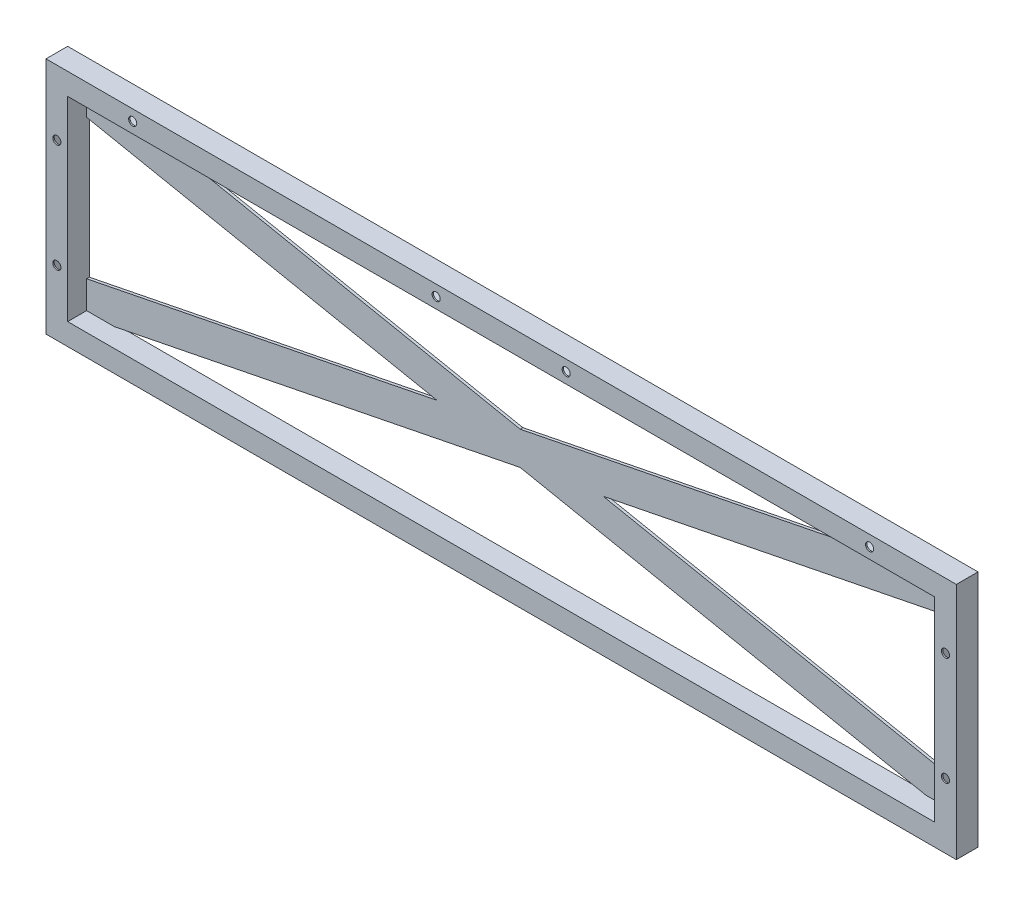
ISO-10303-21;
HEADER;
FILE_DESCRIPTION(('STEP AP214'),'2;1');
FILE_NAME('part.step','',(''),(''),'','','');
FILE_SCHEMA(('AUTOMOTIVE_DESIGN { 1 0 10303 214 1 1 1 1 }'));
ENDSEC;
DATA;
#1=APPLICATION_CONTEXT('core data for automotive mechanical design processes');
#2=APPLICATION_PROTOCOL_DEFINITION('international standard','automotive_design',2000,#1);
#3=PRODUCT_CONTEXT('',#1,'mechanical');
#4=PRODUCT('Part','Part','',(#3));
#5=PRODUCT_RELATED_PRODUCT_CATEGORY('part','',(#4));
#6=PRODUCT_DEFINITION_FORMATION('','',#4);
#7=PRODUCT_DEFINITION_CONTEXT('part definition',#1,'design');
#8=PRODUCT_DEFINITION('design','',#6,#7);
#9=PRODUCT_DEFINITION_SHAPE('','',#8);
#10=(LENGTH_UNIT() NAMED_UNIT(*) SI_UNIT(.MILLI.,.METRE.));
#11=(NAMED_UNIT(*) PLANE_ANGLE_UNIT() SI_UNIT($,.RADIAN.));
#12=(NAMED_UNIT(*) SI_UNIT($,.STERADIAN.) SOLID_ANGLE_UNIT());
#13=UNCERTAINTY_MEASURE_WITH_UNIT(LENGTH_MEASURE(1.E-05),#10,'distance_accuracy_value','');
#14=(GEOMETRIC_REPRESENTATION_CONTEXT(3) GLOBAL_UNCERTAINTY_ASSIGNED_CONTEXT((#13)) GLOBAL_UNIT_ASSIGNED_CONTEXT((#10,
#11,#12)) REPRESENTATION_CONTEXT('',''));
#15=CARTESIAN_POINT('',(0.,0.,0.));
#16=DIRECTION('',(0.,0.,1.));
#17=DIRECTION('',(1.,0.,0.));
#18=AXIS2_PLACEMENT_3D('',#15,#16,#17);
#19=CARTESIAN_POINT('',(0.,0.,25.4));
#20=DIRECTION('',(0.,0.,1.));
#21=DIRECTION('',(1.,0.,0.));
#22=AXIS2_PLACEMENT_3D('',#19,#20,#21);
#23=PLANE('',#22);
#24=CARTESIAN_POINT('',(-431.8,127.,25.4));
#25=DIRECTION('',(0.,0.,-1.));
#26=DIRECTION('',(-1.,0.,0.));
#27=AXIS2_PLACEMENT_3D('',#24,#25,#26);
#28=CIRCLE('',#27,4.76250000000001);
#29=CARTESIAN_POINT('',(-436.5625,127.,25.4));
#30=VERTEX_POINT('',#29);
#31=EDGE_CURVE('E385',#30,#30,#28,.T.);
#32=ORIENTED_EDGE('',*,*,#31,.T.);
#33=EDGE_LOOP('',(#32));
#34=FACE_BOUND('',#33,.T.);
#35=CARTESIAN_POINT('',(76.1999999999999,127.,25.4));
#36=DIRECTION('',(0.,0.,1.));
#37=DIRECTION('',(1.,0.,0.));
#38=AXIS2_PLACEMENT_3D('',#35,#36,#37);
#39=CIRCLE('',#38,4.7625);
#40=CARTESIAN_POINT('',(80.9624999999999,127.,25.4));
#41=VERTEX_POINT('',#40);
#42=EDGE_CURVE('E382',#41,#41,#39,.T.);
#43=ORIENTED_EDGE('',*,*,#42,.F.);
#44=EDGE_LOOP('',(#43));
#45=FACE_BOUND('',#44,.T.);
#46=CARTESIAN_POINT('',(431.8,127.,25.4));
#47=DIRECTION('',(0.,0.,1.));
#48=DIRECTION('',(1.,0.,0.));
#49=AXIS2_PLACEMENT_3D('',#46,#47,#48);
#50=CIRCLE('',#49,4.76250000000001);
#51=CARTESIAN_POINT('',(436.5625,127.,25.4));
#52=VERTEX_POINT('',#51);
#53=EDGE_CURVE('E401',#52,#52,#50,.T.);
#54=ORIENTED_EDGE('',*,*,#53,.F.);
#55=EDGE_LOOP('',(#54));
#56=FACE_BOUND('',#55,.T.);
#57=CARTESIAN_POINT('',(520.7,-63.5000000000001,25.4));
#58=DIRECTION('',(0.,0.,1.));
#59=DIRECTION('',(1.,0.,0.));
#60=AXIS2_PLACEMENT_3D('',#57,#58,#59);
#61=CIRCLE('',#60,4.76250000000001);
#62=CARTESIAN_POINT('',(525.4625,-63.5000000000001,25.4));
#63=VERTEX_POINT('',#62);
#64=EDGE_CURVE('E360',#63,#63,#61,.T.);
#65=ORIENTED_EDGE('',*,*,#64,.F.);
#66=EDGE_LOOP('',(#65));
#67=FACE_BOUND('',#66,.T.);
#68=CARTESIAN_POINT('',(-520.7,63.5000000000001,25.4));
#69=DIRECTION('',(0.,0.,1.));
#70=DIRECTION('',(1.,0.,0.));
#71=AXIS2_PLACEMENT_3D('',#68,#69,#70);
#72=CIRCLE('',#71,4.76250000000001);
#73=CARTESIAN_POINT('',(-515.9375,63.5000000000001,25.4));
#74=VERTEX_POINT('',#73);
#75=EDGE_CURVE('E350',#74,#74,#72,.T.);
#76=ORIENTED_EDGE('',*,*,#75,.F.);
#77=EDGE_LOOP('',(#76));
#78=FACE_BOUND('',#77,.T.);
#79=DIRECTION('',(0.,-1.,0.));
#80=VECTOR('',#79,1.);
#81=CARTESIAN_POINT('',(-533.4,-139.7,25.4));
#82=LINE('',#81,#80);
#83=CARTESIAN_POINT('',(-533.4,139.7,25.4));
#84=VERTEX_POINT('',#83);
#85=CARTESIAN_POINT('',(-533.4,-139.7,25.4));
#86=VERTEX_POINT('',#85);
#87=EDGE_CURVE('E260',#84,#86,#82,.T.);
#88=ORIENTED_EDGE('',*,*,#87,.T.);
#89=DIRECTION('',(1.,0.,0.));
#90=VECTOR('',#89,1.);
#91=CARTESIAN_POINT('',(533.4,-139.7,25.4));
#92=LINE('',#91,#90);
#93=CARTESIAN_POINT('',(533.4,-139.7,25.4));
#94=VERTEX_POINT('',#93);
#95=EDGE_CURVE('E263',#86,#94,#92,.T.);
#96=ORIENTED_EDGE('',*,*,#95,.T.);
#97=DIRECTION('',(0.,1.,0.));
#98=VECTOR('',#97,1.);
#99=CARTESIAN_POINT('',(533.4,-139.7,25.4));
#100=LINE('',#99,#98);
#101=CARTESIAN_POINT('',(533.4,139.7,25.4));
#102=VERTEX_POINT('',#101);
#103=EDGE_CURVE('E266',#94,#102,#100,.T.);
#104=ORIENTED_EDGE('',*,*,#103,.T.);
#105=DIRECTION('',(-1.,0.,0.));
#106=VECTOR('',#105,1.);
#107=CARTESIAN_POINT('',(533.4,139.7,25.4));
#108=LINE('',#107,#106);
#109=EDGE_CURVE('E268',#102,#84,#108,.T.);
#110=ORIENTED_EDGE('',*,*,#109,.T.);
#111=EDGE_LOOP('',(#88,#96,#104,#110));
#112=FACE_BOUND('',#111,.T.);
#113=DIRECTION('',(1.,0.,0.));
#114=VECTOR('',#113,1.);
#115=CARTESIAN_POINT('',(508.,-114.3,25.4));
#116=LINE('',#115,#114);
#117=CARTESIAN_POINT('',(-508.,-114.3,25.4));
#118=VERTEX_POINT('',#117);
#119=CARTESIAN_POINT('',(508.,-114.3,25.4));
#120=VERTEX_POINT('',#119);
#121=EDGE_CURVE('E512',#118,#120,#116,.T.);
#122=ORIENTED_EDGE('',*,*,#121,.F.);
#123=DIRECTION('',(0.,-1.,0.));
#124=VECTOR('',#123,1.);
#125=CARTESIAN_POINT('',(-508.,-114.3,25.4));
#126=LINE('',#125,#124);
#127=CARTESIAN_POINT('',(-508.,114.3,25.4));
#128=VERTEX_POINT('',#127);
#129=EDGE_CURVE('E510',#128,#118,#126,.T.);
#130=ORIENTED_EDGE('',*,*,#129,.F.);
#131=DIRECTION('',(-1.,0.,0.));
#132=VECTOR('',#131,1.);
#133=CARTESIAN_POINT('',(508.,114.3,25.4));
#134=LINE('',#133,#132);
#135=CARTESIAN_POINT('',(508.,114.3,25.4));
#136=VERTEX_POINT('',#135);
#137=EDGE_CURVE('E253',#136,#128,#134,.T.);
#138=ORIENTED_EDGE('',*,*,#137,.F.);
#139=DIRECTION('',(0.,1.,0.));
#140=VECTOR('',#139,1.);
#141=CARTESIAN_POINT('',(508.,-114.3,25.4));
#142=LINE('',#141,#140);
#143=EDGE_CURVE('E244',#120,#136,#142,.T.);
#144=ORIENTED_EDGE('',*,*,#143,.F.);
#145=EDGE_LOOP('',(#122,#130,#138,#144));
#146=FACE_BOUND('',#145,.T.);
#147=CARTESIAN_POINT('',(-520.7,-63.5000000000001,25.4));
#148=DIRECTION('',(0.,0.,1.));
#149=DIRECTION('',(-1.,0.,0.));
#150=AXIS2_PLACEMENT_3D('',#147,#148,#149);
#151=CIRCLE('',#150,4.76250000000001);
#152=CARTESIAN_POINT('',(-525.4625,-63.5000000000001,25.4));
#153=VERTEX_POINT('',#152);
#154=EDGE_CURVE('E355',#153,#153,#151,.T.);
#155=ORIENTED_EDGE('',*,*,#154,.F.);
#156=EDGE_LOOP('',(#155));
#157=FACE_BOUND('',#156,.T.);
#158=CARTESIAN_POINT('',(520.7,63.5000000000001,25.4));
#159=DIRECTION('',(0.,0.,1.));
#160=DIRECTION('',(-1.,0.,0.));
#161=AXIS2_PLACEMENT_3D('',#158,#159,#160);
#162=CIRCLE('',#161,4.76250000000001);
#163=CARTESIAN_POINT('',(515.9375,63.5000000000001,25.4));
#164=VERTEX_POINT('',#163);
#165=EDGE_CURVE('E365',#164,#164,#162,.T.);
#166=ORIENTED_EDGE('',*,*,#165,.F.);
#167=EDGE_LOOP('',(#166));
#168=FACE_BOUND('',#167,.T.);
#169=CARTESIAN_POINT('',(-76.1999999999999,127.,25.4));
#170=DIRECTION('',(0.,0.,-1.));
#171=DIRECTION('',(-1.,0.,0.));
#172=AXIS2_PLACEMENT_3D('',#169,#170,#171);
#173=CIRCLE('',#172,4.7625);
#174=CARTESIAN_POINT('',(-80.9624999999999,127.,25.4));
#175=VERTEX_POINT('',#174);
#176=EDGE_CURVE('E563',#175,#175,#173,.T.);
#177=ORIENTED_EDGE('',*,*,#176,.T.);
#178=EDGE_LOOP('',(#177));
#179=FACE_BOUND('',#178,.T.);
#180=ADVANCED_FACE('F35',(#34,#45,#56,#67,#78,#112,#146,#157,#168,#179),#23,.T.);
#181=CARTESIAN_POINT('',(0.,0.,0.));
#182=DIRECTION('',(0.,0.,1.));
#183=DIRECTION('',(1.,0.,0.));
#184=AXIS2_PLACEMENT_3D('',#181,#182,#183);
#185=PLANE('',#184);
#186=CARTESIAN_POINT('',(-431.8,127.,0.));
#187=DIRECTION('',(0.,0.,-1.));
#188=DIRECTION('',(-1.,0.,0.));
#189=AXIS2_PLACEMENT_3D('',#186,#187,#188);
#190=CIRCLE('',#189,4.76250000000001);
#191=CARTESIAN_POINT('',(-436.5625,127.,0.));
#192=VERTEX_POINT('',#191);
#193=EDGE_CURVE('E378',#192,#192,#190,.T.);
#194=ORIENTED_EDGE('',*,*,#193,.F.);
#195=EDGE_LOOP('',(#194));
#196=FACE_BOUND('',#195,.T.);
#197=CARTESIAN_POINT('',(76.1999999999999,127.,0.));
#198=DIRECTION('',(0.,0.,1.));
#199=DIRECTION('',(1.,0.,0.));
#200=AXIS2_PLACEMENT_3D('',#197,#198,#199);
#201=CIRCLE('',#200,4.7625);
#202=CARTESIAN_POINT('',(80.9624999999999,127.,0.));
#203=VERTEX_POINT('',#202);
#204=EDGE_CURVE('E374',#203,#203,#201,.T.);
#205=ORIENTED_EDGE('',*,*,#204,.T.);
#206=EDGE_LOOP('',(#205));
#207=FACE_BOUND('',#206,.T.);
#208=CARTESIAN_POINT('',(431.8,127.,0.));
#209=DIRECTION('',(0.,0.,1.));
#210=DIRECTION('',(1.,0.,0.));
#211=AXIS2_PLACEMENT_3D('',#208,#209,#210);
#212=CIRCLE('',#211,4.76250000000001);
#213=CARTESIAN_POINT('',(436.5625,127.,0.));
#214=VERTEX_POINT('',#213);
#215=EDGE_CURVE('E370',#214,#214,#212,.T.);
#216=ORIENTED_EDGE('',*,*,#215,.T.);
#217=EDGE_LOOP('',(#216));
#218=FACE_BOUND('',#217,.T.);
#219=CARTESIAN_POINT('',(520.7,-63.5000000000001,0.));
#220=DIRECTION('',(0.,0.,1.));
#221=DIRECTION('',(1.,0.,0.));
#222=AXIS2_PLACEMENT_3D('',#219,#220,#221);
#223=CIRCLE('',#222,4.76250000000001);
#224=CARTESIAN_POINT('',(525.4625,-63.5000000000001,0.));
#225=VERTEX_POINT('',#224);
#226=EDGE_CURVE('E415',#225,#225,#223,.T.);
#227=ORIENTED_EDGE('',*,*,#226,.T.);
#228=EDGE_LOOP('',(#227));
#229=FACE_BOUND('',#228,.T.);
#230=CARTESIAN_POINT('',(-520.7,63.5000000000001,0.));
#231=DIRECTION('',(0.,0.,1.));
#232=DIRECTION('',(1.,0.,0.));
#233=AXIS2_PLACEMENT_3D('',#230,#231,#232);
#234=CIRCLE('',#233,4.76250000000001);
#235=CARTESIAN_POINT('',(-515.9375,63.5000000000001,0.));
#236=VERTEX_POINT('',#235);
#237=EDGE_CURVE('E429',#236,#236,#234,.T.);
#238=ORIENTED_EDGE('',*,*,#237,.T.);
#239=EDGE_LOOP('',(#238));
#240=FACE_BOUND('',#239,.T.);
#241=DIRECTION('',(0.980678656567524,-0.19562559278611,0.));
#242=VECTOR('',#241,1.);
#243=CARTESIAN_POINT('',(-475.610420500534,114.3,0.));
#244=LINE('',#243,#242);
#245=CARTESIAN_POINT('',(-475.610420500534,114.3,0.));
#246=VERTEX_POINT('',#245);
#247=CARTESIAN_POINT('',(2.16493489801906E-12,19.4253233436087,0.));
#248=VERTEX_POINT('',#247);
#249=EDGE_CURVE('E493',#246,#248,#244,.T.);
#250=ORIENTED_EDGE('',*,*,#249,.T.);
#251=DIRECTION('',(-0.980678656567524,-0.19562559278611,0.));
#252=VECTOR('',#251,1.);
#253=CARTESIAN_POINT('',(475.610420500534,114.3,0.));
#254=LINE('',#253,#252);
#255=CARTESIAN_POINT('',(475.610420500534,114.3,0.));
#256=VERTEX_POINT('',#255);
#257=EDGE_CURVE('E239',#256,#248,#254,.T.);
#258=ORIENTED_EDGE('',*,*,#257,.F.);
#259=DIRECTION('',(-1.,0.,0.));
#260=VECTOR('',#259,1.);
#261=CARTESIAN_POINT('',(508.,114.3,0.));
#262=LINE('',#261,#260);
#263=EDGE_CURVE('E513',#256,#246,#262,.T.);
#264=ORIENTED_EDGE('',*,*,#263,.T.);
#265=EDGE_LOOP('',(#250,#258,#264));
#266=FACE_BOUND('',#265,.T.);
#267=DIRECTION('',(-0.980678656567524,0.19562559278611,0.));
#268=VECTOR('',#267,1.);
#269=CARTESIAN_POINT('',(-508.,81.9104205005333,0.));
#270=LINE('',#269,#268);
#271=CARTESIAN_POINT('',(475.610420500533,-114.3,0.));
#272=VERTEX_POINT('',#271);
#273=CARTESIAN_POINT('',(-4.9960036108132E-13,-19.4253233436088,0.));
#274=VERTEX_POINT('',#273);
#275=EDGE_CURVE('E475',#272,#274,#270,.T.);
#276=ORIENTED_EDGE('',*,*,#275,.T.);
#277=DIRECTION('',(0.980678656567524,0.19562559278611,0.));
#278=VECTOR('',#277,1.);
#279=CARTESIAN_POINT('',(508.,81.9104205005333,0.));
#280=LINE('',#279,#278);
#281=CARTESIAN_POINT('',(-475.610420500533,-114.3,0.));
#282=VERTEX_POINT('',#281);
#283=EDGE_CURVE('E52',#282,#274,#280,.T.);
#284=ORIENTED_EDGE('',*,*,#283,.F.);
#285=DIRECTION('',(1.,0.,0.));
#286=VECTOR('',#285,1.);
#287=CARTESIAN_POINT('',(508.,-114.3,0.));
#288=LINE('',#287,#286);
#289=EDGE_CURVE('E519',#282,#272,#288,.T.);
#290=ORIENTED_EDGE('',*,*,#289,.T.);
#291=EDGE_LOOP('',(#276,#284,#290));
#292=FACE_BOUND('',#291,.T.);
#293=CARTESIAN_POINT('',(97.3798966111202,-5.68989300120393E-13,0.));
#294=VERTEX_POINT('',#293);
#295=CARTESIAN_POINT('',(508.,81.9104205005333,0.));
#296=VERTEX_POINT('',#295);
#297=EDGE_CURVE('E435',#294,#296,#280,.T.);
#298=ORIENTED_EDGE('',*,*,#297,.F.);
#299=CARTESIAN_POINT('',(508.,-81.9104205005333,0.));
#300=VERTEX_POINT('',#299);
#301=EDGE_CURVE('E470',#294,#300,#244,.T.);
#302=ORIENTED_EDGE('',*,*,#301,.T.);
#303=DIRECTION('',(0.,1.,0.));
#304=VECTOR('',#303,1.);
#305=CARTESIAN_POINT('',(508.,-114.3,0.));
#306=LINE('',#305,#304);
#307=EDGE_CURVE('E521',#300,#296,#306,.T.);
#308=ORIENTED_EDGE('',*,*,#307,.T.);
#309=EDGE_LOOP('',(#298,#302,#308));
#310=FACE_BOUND('',#309,.T.);
#311=DIRECTION('',(0.,-1.,0.));
#312=VECTOR('',#311,1.);
#313=CARTESIAN_POINT('',(-508.,-114.3,0.));
#314=LINE('',#313,#312);
#315=CARTESIAN_POINT('',(-508.,81.9104205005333,0.));
#316=VERTEX_POINT('',#315);
#317=CARTESIAN_POINT('',(-508.,-81.9104205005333,0.));
#318=VERTEX_POINT('',#317);
#319=EDGE_CURVE('E501',#316,#318,#314,.T.);
#320=ORIENTED_EDGE('',*,*,#319,.T.);
#321=CARTESIAN_POINT('',(-97.3798966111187,1.80411241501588E-13,0.));
#322=VERTEX_POINT('',#321);
#323=EDGE_CURVE('E449',#322,#318,#254,.T.);
#324=ORIENTED_EDGE('',*,*,#323,.F.);
#325=EDGE_CURVE('E496',#322,#316,#270,.T.);
#326=ORIENTED_EDGE('',*,*,#325,.T.);
#327=EDGE_LOOP('',(#320,#324,#326));
#328=FACE_BOUND('',#327,.T.);
#329=DIRECTION('',(0.,-1.,0.));
#330=VECTOR('',#329,1.);
#331=CARTESIAN_POINT('',(-533.4,-139.7,0.));
#332=LINE('',#331,#330);
#333=CARTESIAN_POINT('',(-533.4,139.7,0.));
#334=VERTEX_POINT('',#333);
#335=CARTESIAN_POINT('',(-533.4,-139.7,0.));
#336=VERTEX_POINT('',#335);
#337=EDGE_CURVE('E259',#334,#336,#332,.T.);
#338=ORIENTED_EDGE('',*,*,#337,.F.);
#339=DIRECTION('',(-1.,0.,0.));
#340=VECTOR('',#339,1.);
#341=CARTESIAN_POINT('',(533.4,139.7,0.));
#342=LINE('',#341,#340);
#343=CARTESIAN_POINT('',(533.4,139.7,0.));
#344=VERTEX_POINT('',#343);
#345=EDGE_CURVE('E264',#344,#334,#342,.T.);
#346=ORIENTED_EDGE('',*,*,#345,.F.);
#347=DIRECTION('',(0.,1.,0.));
#348=VECTOR('',#347,1.);
#349=CARTESIAN_POINT('',(533.4,-139.7,0.));
#350=LINE('',#349,#348);
#351=CARTESIAN_POINT('',(533.4,-139.7,0.));
#352=VERTEX_POINT('',#351);
#353=EDGE_CURVE('E275',#352,#344,#350,.T.);
#354=ORIENTED_EDGE('',*,*,#353,.F.);
#355=DIRECTION('',(1.,0.,0.));
#356=VECTOR('',#355,1.);
#357=CARTESIAN_POINT('',(533.4,-139.7,0.));
#358=LINE('',#357,#356);
#359=EDGE_CURVE('E273',#336,#352,#358,.T.);
#360=ORIENTED_EDGE('',*,*,#359,.F.);
#361=EDGE_LOOP('',(#338,#346,#354,#360));
#362=FACE_BOUND('',#361,.T.);
#363=CARTESIAN_POINT('',(-520.7,-63.5000000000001,0.));
#364=DIRECTION('',(0.,0.,1.));
#365=DIRECTION('',(-1.,0.,0.));
#366=AXIS2_PLACEMENT_3D('',#363,#364,#365);
#367=CIRCLE('',#366,4.76250000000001);
#368=CARTESIAN_POINT('',(-525.4625,-63.5000000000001,0.));
#369=VERTEX_POINT('',#368);
#370=EDGE_CURVE('E422',#369,#369,#367,.T.);
#371=ORIENTED_EDGE('',*,*,#370,.T.);
#372=EDGE_LOOP('',(#371));
#373=FACE_BOUND('',#372,.T.);
#374=CARTESIAN_POINT('',(520.7,63.5000000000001,0.));
#375=DIRECTION('',(0.,0.,1.));
#376=DIRECTION('',(-1.,0.,0.));
#377=AXIS2_PLACEMENT_3D('',#374,#375,#376);
#378=CIRCLE('',#377,4.76250000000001);
#379=CARTESIAN_POINT('',(515.9375,63.5000000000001,0.));
#380=VERTEX_POINT('',#379);
#381=EDGE_CURVE('E408',#380,#380,#378,.T.);
#382=ORIENTED_EDGE('',*,*,#381,.T.);
#383=EDGE_LOOP('',(#382));
#384=FACE_BOUND('',#383,.T.);
#385=CARTESIAN_POINT('',(-76.1999999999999,127.,0.));
#386=DIRECTION('',(0.,0.,-1.));
#387=DIRECTION('',(-1.,0.,0.));
#388=AXIS2_PLACEMENT_3D('',#385,#386,#387);
#389=CIRCLE('',#388,4.7625);
#390=CARTESIAN_POINT('',(-80.9624999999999,127.,0.));
#391=VERTEX_POINT('',#390);
#392=EDGE_CURVE('E565',#391,#391,#389,.T.);
#393=ORIENTED_EDGE('',*,*,#392,.F.);
#394=EDGE_LOOP('',(#393));
#395=FACE_BOUND('',#394,.T.);
#396=ADVANCED_FACE('F525',(#196,#207,#218,#229,#240,#266,#292,#310,#328,#362,#373,#384,#395),
#185,.F.);
#397=CARTESIAN_POINT('',(0.,0.,23.8125));
#398=DIRECTION('',(0.,0.,1.));
#399=DIRECTION('',(1.,0.,0.));
#400=AXIS2_PLACEMENT_3D('',#397,#398,#399);
#401=PLANE('',#400);
#402=CARTESIAN_POINT('',(-431.8,127.,23.8125));
#403=DIRECTION('',(0.,0.,1.));
#404=DIRECTION('',(1.,0.,0.));
#405=AXIS2_PLACEMENT_3D('',#402,#403,#404);
#406=CIRCLE('',#405,4.76250000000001);
#407=CARTESIAN_POINT('',(-427.0375,127.,23.8125));
#408=VERTEX_POINT('',#407);
#409=EDGE_CURVE('E377',#408,#408,#406,.F.);
#410=ORIENTED_EDGE('',*,*,#409,.F.);
#411=EDGE_LOOP('',(#410));
#412=FACE_BOUND('',#411,.T.);
#413=CARTESIAN_POINT('',(76.1999999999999,127.,23.8125));
#414=DIRECTION('',(0.,0.,1.));
#415=DIRECTION('',(1.,0.,0.));
#416=AXIS2_PLACEMENT_3D('',#413,#414,#415);
#417=CIRCLE('',#416,4.7625);
#418=CARTESIAN_POINT('',(80.9624999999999,127.,23.8125));
#419=VERTEX_POINT('',#418);
#420=EDGE_CURVE('E373',#419,#419,#417,.T.);
#421=ORIENTED_EDGE('',*,*,#420,.T.);
#422=EDGE_LOOP('',(#421));
#423=FACE_BOUND('',#422,.T.);
#424=CARTESIAN_POINT('',(431.8,127.,23.8125));
#425=DIRECTION('',(0.,0.,1.));
#426=DIRECTION('',(1.,0.,0.));
#427=AXIS2_PLACEMENT_3D('',#424,#425,#426);
#428=CIRCLE('',#427,4.76250000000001);
#429=CARTESIAN_POINT('',(436.5625,127.,23.8125));
#430=VERTEX_POINT('',#429);
#431=EDGE_CURVE('E369',#430,#430,#428,.T.);
#432=ORIENTED_EDGE('',*,*,#431,.T.);
#433=EDGE_LOOP('',(#432));
#434=FACE_BOUND('',#433,.T.);
#435=CARTESIAN_POINT('',(520.7,-63.5000000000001,23.8125));
#436=DIRECTION('',(0.,0.,1.));
#437=DIRECTION('',(1.,0.,0.));
#438=AXIS2_PLACEMENT_3D('',#435,#436,#437);
#439=CIRCLE('',#438,4.76250000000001);
#440=CARTESIAN_POINT('',(525.4625,-63.5000000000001,23.8125));
#441=VERTEX_POINT('',#440);
#442=EDGE_CURVE('E359',#441,#441,#439,.F.);
#443=ORIENTED_EDGE('',*,*,#442,.F.);
#444=EDGE_LOOP('',(#443));
#445=FACE_BOUND('',#444,.T.);
#446=CARTESIAN_POINT('',(-520.7,63.5000000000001,23.8125));
#447=DIRECTION('',(0.,0.,1.));
#448=DIRECTION('',(1.,0.,0.));
#449=AXIS2_PLACEMENT_3D('',#446,#447,#448);
#450=CIRCLE('',#449,4.76250000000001);
#451=CARTESIAN_POINT('',(-515.9375,63.5000000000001,23.8125));
#452=VERTEX_POINT('',#451);
#453=EDGE_CURVE('E349',#452,#452,#450,.F.);
#454=ORIENTED_EDGE('',*,*,#453,.F.);
#455=EDGE_LOOP('',(#454));
#456=FACE_BOUND('',#455,.T.);
#457=DIRECTION('',(0.,-1.,0.));
#458=VECTOR('',#457,1.);
#459=CARTESIAN_POINT('',(-531.8125,-139.7,23.8125));
#460=LINE('',#459,#458);
#461=CARTESIAN_POINT('',(-531.8125,138.1125,23.8125));
#462=VERTEX_POINT('',#461);
#463=CARTESIAN_POINT('',(-531.8125,-138.1125,23.8125));
#464=VERTEX_POINT('',#463);
#465=EDGE_CURVE('E288',#462,#464,#460,.T.);
#466=ORIENTED_EDGE('',*,*,#465,.F.);
#467=DIRECTION('',(-1.,0.,0.));
#468=VECTOR('',#467,1.);
#469=CARTESIAN_POINT('',(533.4,138.1125,23.8125));
#470=LINE('',#469,#468);
#471=CARTESIAN_POINT('',(531.8125,138.1125,23.8125));
#472=VERTEX_POINT('',#471);
#473=EDGE_CURVE('E338',#472,#462,#470,.T.);
#474=ORIENTED_EDGE('',*,*,#473,.F.);
#475=DIRECTION('',(0.,1.,0.));
#476=VECTOR('',#475,1.);
#477=CARTESIAN_POINT('',(531.8125,-139.7,23.8125));
#478=LINE('',#477,#476);
#479=CARTESIAN_POINT('',(531.8125,-138.1125,23.8125));
#480=VERTEX_POINT('',#479);
#481=EDGE_CURVE('E340',#480,#472,#478,.T.);
#482=ORIENTED_EDGE('',*,*,#481,.F.);
#483=DIRECTION('',(1.,0.,0.));
#484=VECTOR('',#483,1.);
#485=CARTESIAN_POINT('',(533.4,-138.1125,23.8125));
#486=LINE('',#485,#484);
#487=EDGE_CURVE('E342',#464,#480,#486,.T.);
#488=ORIENTED_EDGE('',*,*,#487,.F.);
#489=EDGE_LOOP('',(#466,#474,#482,#488));
#490=FACE_BOUND('',#489,.T.);
#491=DIRECTION('',(1.,0.,0.));
#492=VECTOR('',#491,1.);
#493=CARTESIAN_POINT('',(508.,-115.8875,23.8125));
#494=LINE('',#493,#492);
#495=CARTESIAN_POINT('',(-509.5875,-115.8875,23.8125));
#496=VERTEX_POINT('',#495);
#497=CARTESIAN_POINT('',(509.5875,-115.8875,23.8125));
#498=VERTEX_POINT('',#497);
#499=EDGE_CURVE('E298',#496,#498,#494,.T.);
#500=ORIENTED_EDGE('',*,*,#499,.T.);
#501=DIRECTION('',(0.,1.,0.));
#502=VECTOR('',#501,1.);
#503=CARTESIAN_POINT('',(509.5875,-114.3,23.8125));
#504=LINE('',#503,#502);
#505=CARTESIAN_POINT('',(509.5875,115.8875,23.8125));
#506=VERTEX_POINT('',#505);
#507=EDGE_CURVE('E293',#498,#506,#504,.T.);
#508=ORIENTED_EDGE('',*,*,#507,.T.);
#509=DIRECTION('',(-1.,0.,0.));
#510=VECTOR('',#509,1.);
#511=CARTESIAN_POINT('',(508.,115.8875,23.8125));
#512=LINE('',#511,#510);
#513=CARTESIAN_POINT('',(-509.5875,115.8875,23.8125));
#514=VERTEX_POINT('',#513);
#515=EDGE_CURVE('E44',#506,#514,#512,.T.);
#516=ORIENTED_EDGE('',*,*,#515,.T.);
#517=DIRECTION('',(0.,-1.,0.));
#518=VECTOR('',#517,1.);
#519=CARTESIAN_POINT('',(-509.5875,-114.3,23.8125));
#520=LINE('',#519,#518);
#521=EDGE_CURVE('E303',#514,#496,#520,.T.);
#522=ORIENTED_EDGE('',*,*,#521,.T.);
#523=EDGE_LOOP('',(#500,#508,#516,#522));
#524=FACE_BOUND('',#523,.T.);
#525=CARTESIAN_POINT('',(-520.7,-63.5000000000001,23.8125));
#526=DIRECTION('',(0.,0.,1.));
#527=DIRECTION('',(1.,0.,0.));
#528=AXIS2_PLACEMENT_3D('',#525,#526,#527);
#529=CIRCLE('',#528,4.76250000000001);
#530=CARTESIAN_POINT('',(-515.9375,-63.5000000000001,23.8125));
#531=VERTEX_POINT('',#530);
#532=EDGE_CURVE('E354',#531,#531,#529,.F.);
#533=ORIENTED_EDGE('',*,*,#532,.F.);
#534=EDGE_LOOP('',(#533));
#535=FACE_BOUND('',#534,.T.);
#536=CARTESIAN_POINT('',(520.7,63.5000000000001,23.8125));
#537=DIRECTION('',(0.,0.,1.));
#538=DIRECTION('',(1.,0.,0.));
#539=AXIS2_PLACEMENT_3D('',#536,#537,#538);
#540=CIRCLE('',#539,4.76250000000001);
#541=CARTESIAN_POINT('',(525.4625,63.5000000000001,23.8125));
#542=VERTEX_POINT('',#541);
#543=EDGE_CURVE('E364',#542,#542,#540,.F.);
#544=ORIENTED_EDGE('',*,*,#543,.F.);
#545=EDGE_LOOP('',(#544));
#546=FACE_BOUND('',#545,.T.);
#547=CARTESIAN_POINT('',(-76.1999999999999,127.,23.8125));
#548=DIRECTION('',(0.,0.,1.));
#549=DIRECTION('',(1.,0.,0.));
#550=AXIS2_PLACEMENT_3D('',#547,#548,#549);
#551=CIRCLE('',#550,4.7625);
#552=CARTESIAN_POINT('',(-71.4374999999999,127.,23.8125));
#553=VERTEX_POINT('',#552);
#554=EDGE_CURVE('E390',#553,#553,#551,.F.);
#555=ORIENTED_EDGE('',*,*,#554,.F.);
#556=EDGE_LOOP('',(#555));
#557=FACE_BOUND('',#556,.T.);
#558=ADVANCED_FACE('F578',(#412,#423,#434,#445,#456,#490,#524,#535,#546,#557),#401,.F.);
#559=CARTESIAN_POINT('',(0.,0.,1.5875));
#560=DIRECTION('',(0.,0.,1.));
#561=DIRECTION('',(1.,0.,0.));
#562=AXIS2_PLACEMENT_3D('',#559,#560,#561);
#563=PLANE('',#562);
#564=CARTESIAN_POINT('',(-431.8,127.,1.5875));
#565=DIRECTION('',(0.,0.,1.));
#566=DIRECTION('',(1.,0.,0.));
#567=AXIS2_PLACEMENT_3D('',#564,#565,#566);
#568=CIRCLE('',#567,4.76250000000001);
#569=CARTESIAN_POINT('',(-427.0375,127.,1.5875));
#570=VERTEX_POINT('',#569);
#571=EDGE_CURVE('E375',#570,#570,#568,.F.);
#572=ORIENTED_EDGE('',*,*,#571,.T.);
#573=EDGE_LOOP('',(#572));
#574=FACE_BOUND('',#573,.T.);
#575=CARTESIAN_POINT('',(76.1999999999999,127.,1.5875));
#576=DIRECTION('',(0.,0.,1.));
#577=DIRECTION('',(1.,0.,0.));
#578=AXIS2_PLACEMENT_3D('',#575,#576,#577);
#579=CIRCLE('',#578,4.7625);
#580=CARTESIAN_POINT('',(80.9624999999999,127.,1.5875));
#581=VERTEX_POINT('',#580);
#582=EDGE_CURVE('E371',#581,#581,#579,.T.);
#583=ORIENTED_EDGE('',*,*,#582,.F.);
#584=EDGE_LOOP('',(#583));
#585=FACE_BOUND('',#584,.T.);
#586=CARTESIAN_POINT('',(431.8,127.,1.5875));
#587=DIRECTION('',(0.,0.,1.));
#588=DIRECTION('',(1.,0.,0.));
#589=AXIS2_PLACEMENT_3D('',#586,#587,#588);
#590=CIRCLE('',#589,4.76250000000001);
#591=CARTESIAN_POINT('',(436.5625,127.,1.5875));
#592=VERTEX_POINT('',#591);
#593=EDGE_CURVE('E366',#592,#592,#590,.T.);
#594=ORIENTED_EDGE('',*,*,#593,.F.);
#595=EDGE_LOOP('',(#594));
#596=FACE_BOUND('',#595,.T.);
#597=CARTESIAN_POINT('',(520.7,-63.5000000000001,1.5875));
#598=DIRECTION('',(0.,0.,1.));
#599=DIRECTION('',(1.,0.,0.));
#600=AXIS2_PLACEMENT_3D('',#597,#598,#599);
#601=CIRCLE('',#600,4.76250000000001);
#602=CARTESIAN_POINT('',(525.4625,-63.5000000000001,1.5875));
#603=VERTEX_POINT('',#602);
#604=EDGE_CURVE('E356',#603,#603,#601,.F.);
#605=ORIENTED_EDGE('',*,*,#604,.T.);
#606=EDGE_LOOP('',(#605));
#607=FACE_BOUND('',#606,.T.);
#608=CARTESIAN_POINT('',(-520.7,63.5000000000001,1.5875));
#609=DIRECTION('',(0.,0.,1.));
#610=DIRECTION('',(1.,0.,0.));
#611=AXIS2_PLACEMENT_3D('',#608,#609,#610);
#612=CIRCLE('',#611,4.76250000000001);
#613=CARTESIAN_POINT('',(-515.9375,63.5000000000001,1.5875));
#614=VERTEX_POINT('',#613);
#615=EDGE_CURVE('E346',#614,#614,#612,.F.);
#616=ORIENTED_EDGE('',*,*,#615,.T.);
#617=EDGE_LOOP('',(#616));
#618=FACE_BOUND('',#617,.T.);
#619=DIRECTION('',(0.,-1.,0.));
#620=VECTOR('',#619,1.);
#621=CARTESIAN_POINT('',(-531.8125,-139.7,1.5875));
#622=LINE('',#621,#620);
#623=CARTESIAN_POINT('',(-531.8125,138.1125,1.5875));
#624=VERTEX_POINT('',#623);
#625=CARTESIAN_POINT('',(-531.8125,-138.1125,1.5875));
#626=VERTEX_POINT('',#625);
#627=EDGE_CURVE('E323',#624,#626,#622,.T.);
#628=ORIENTED_EDGE('',*,*,#627,.T.);
#629=DIRECTION('',(1.,0.,0.));
#630=VECTOR('',#629,1.);
#631=CARTESIAN_POINT('',(533.4,-138.1125,1.5875));
#632=LINE('',#631,#630);
#633=CARTESIAN_POINT('',(531.8125,-138.1125,1.5875));
#634=VERTEX_POINT('',#633);
#635=EDGE_CURVE('E318',#626,#634,#632,.T.);
#636=ORIENTED_EDGE('',*,*,#635,.T.);
#637=DIRECTION('',(0.,1.,0.));
#638=VECTOR('',#637,1.);
#639=CARTESIAN_POINT('',(531.8125,-139.7,1.5875));
#640=LINE('',#639,#638);
#641=CARTESIAN_POINT('',(531.8125,138.1125,1.5875));
#642=VERTEX_POINT('',#641);
#643=EDGE_CURVE('E313',#634,#642,#640,.T.);
#644=ORIENTED_EDGE('',*,*,#643,.T.);
#645=DIRECTION('',(-1.,0.,0.));
#646=VECTOR('',#645,1.);
#647=CARTESIAN_POINT('',(533.4,138.1125,1.5875));
#648=LINE('',#647,#646);
#649=EDGE_CURVE('E308',#642,#624,#648,.T.);
#650=ORIENTED_EDGE('',*,*,#649,.T.);
#651=EDGE_LOOP('',(#628,#636,#644,#650));
#652=FACE_BOUND('',#651,.T.);
#653=DIRECTION('',(0.,-1.,0.));
#654=VECTOR('',#653,1.);
#655=CARTESIAN_POINT('',(-509.5875,-114.3,1.5875));
#656=LINE('',#655,#654);
#657=CARTESIAN_POINT('',(-509.5875,115.8875,1.5875));
#658=VERTEX_POINT('',#657);
#659=CARTESIAN_POINT('',(-509.5875,-115.8875,1.5875));
#660=VERTEX_POINT('',#659);
#661=EDGE_CURVE('E335',#658,#660,#656,.T.);
#662=ORIENTED_EDGE('',*,*,#661,.F.);
#663=DIRECTION('',(-1.,0.,0.));
#664=VECTOR('',#663,1.);
#665=CARTESIAN_POINT('',(508.,115.8875,1.5875));
#666=LINE('',#665,#664);
#667=CARTESIAN_POINT('',(509.5875,115.8875,1.5875));
#668=VERTEX_POINT('',#667);
#669=EDGE_CURVE('E326',#668,#658,#666,.T.);
#670=ORIENTED_EDGE('',*,*,#669,.F.);
#671=DIRECTION('',(0.,1.,0.));
#672=VECTOR('',#671,1.);
#673=CARTESIAN_POINT('',(509.5875,-114.3,1.5875));
#674=LINE('',#673,#672);
#675=CARTESIAN_POINT('',(509.5875,-115.8875,1.5875));
#676=VERTEX_POINT('',#675);
#677=EDGE_CURVE('E329',#676,#668,#674,.T.);
#678=ORIENTED_EDGE('',*,*,#677,.F.);
#679=DIRECTION('',(1.,0.,0.));
#680=VECTOR('',#679,1.);
#681=CARTESIAN_POINT('',(508.,-115.8875,1.5875));
#682=LINE('',#681,#680);
#683=EDGE_CURVE('E332',#660,#676,#682,.T.);
#684=ORIENTED_EDGE('',*,*,#683,.F.);
#685=EDGE_LOOP('',(#662,#670,#678,#684));
#686=FACE_BOUND('',#685,.T.);
#687=CARTESIAN_POINT('',(-520.7,-63.5000000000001,1.5875));
#688=DIRECTION('',(0.,0.,1.));
#689=DIRECTION('',(1.,0.,0.));
#690=AXIS2_PLACEMENT_3D('',#687,#688,#689);
#691=CIRCLE('',#690,4.76250000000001);
#692=CARTESIAN_POINT('',(-515.9375,-63.5000000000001,1.5875));
#693=VERTEX_POINT('',#692);
#694=EDGE_CURVE('E351',#693,#693,#691,.F.);
#695=ORIENTED_EDGE('',*,*,#694,.T.);
#696=EDGE_LOOP('',(#695));
#697=FACE_BOUND('',#696,.T.);
#698=CARTESIAN_POINT('',(520.7,63.5000000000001,1.5875));
#699=DIRECTION('',(0.,0.,1.));
#700=DIRECTION('',(1.,0.,0.));
#701=AXIS2_PLACEMENT_3D('',#698,#699,#700);
#702=CIRCLE('',#701,4.76250000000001);
#703=CARTESIAN_POINT('',(525.4625,63.5000000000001,1.5875));
#704=VERTEX_POINT('',#703);
#705=EDGE_CURVE('E361',#704,#704,#702,.F.);
#706=ORIENTED_EDGE('',*,*,#705,.T.);
#707=EDGE_LOOP('',(#706));
#708=FACE_BOUND('',#707,.T.);
#709=CARTESIAN_POINT('',(-76.1999999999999,127.,1.5875));
#710=DIRECTION('',(0.,0.,1.));
#711=DIRECTION('',(1.,0.,0.));
#712=AXIS2_PLACEMENT_3D('',#709,#710,#711);
#713=CIRCLE('',#712,4.7625);
#714=CARTESIAN_POINT('',(-71.4374999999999,127.,1.5875));
#715=VERTEX_POINT('',#714);
#716=EDGE_CURVE('E39',#715,#715,#713,.F.);
#717=ORIENTED_EDGE('',*,*,#716,.T.);
#718=EDGE_LOOP('',(#717));
#719=FACE_BOUND('',#718,.T.);
#720=ADVANCED_FACE('F580',(#574,#585,#596,#607,#618,#652,#686,#697,#708,#719),#563,.T.);
#721=CARTESIAN_POINT('',(-508.,-114.3,25.4));
#722=DIRECTION('',(1.,0.,0.));
#723=DIRECTION('',(0.,0.,-1.));
#724=AXIS2_PLACEMENT_3D('',#721,#722,#723);
#725=PLANE('',#724);
#726=DIRECTION('',(0.,-1.,0.));
#727=VECTOR('',#726,1.);
#728=CARTESIAN_POINT('',(-508.,-81.9104205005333,3.175));
#729=LINE('',#728,#727);
#730=CARTESIAN_POINT('',(-508.,-81.9104205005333,3.175));
#731=VERTEX_POINT('',#730);
#732=CARTESIAN_POINT('',(-508.,-114.3,3.175));
#733=VERTEX_POINT('',#732);
#734=EDGE_CURVE('E442',#731,#733,#729,.T.);
#735=ORIENTED_EDGE('',*,*,#734,.F.);
#736=DIRECTION('',(0.,0.,-1.));
#737=VECTOR('',#736,1.);
#738=CARTESIAN_POINT('',(-508.,-81.9104205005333,3.175));
#739=LINE('',#738,#737);
#740=EDGE_CURVE('E453',#731,#318,#739,.T.);
#741=ORIENTED_EDGE('',*,*,#740,.T.);
#742=ORIENTED_EDGE('',*,*,#319,.F.);
#743=DIRECTION('',(0.,0.,-1.));
#744=VECTOR('',#743,1.);
#745=CARTESIAN_POINT('',(-508.,81.9104205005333,3.175));
#746=LINE('',#745,#744);
#747=CARTESIAN_POINT('',(-508.,81.9104205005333,3.175));
#748=VERTEX_POINT('',#747);
#749=EDGE_CURVE('E498',#748,#316,#746,.T.);
#750=ORIENTED_EDGE('',*,*,#749,.F.);
#751=DIRECTION('',(0.,1.,0.));
#752=VECTOR('',#751,1.);
#753=CARTESIAN_POINT('',(-508.,114.3,3.175));
#754=LINE('',#753,#752);
#755=CARTESIAN_POINT('',(-508.,114.3,3.175));
#756=VERTEX_POINT('',#755);
#757=EDGE_CURVE('E489',#748,#756,#754,.T.);
#758=ORIENTED_EDGE('',*,*,#757,.T.);
#759=DIRECTION('',(0.,0.,-1.));
#760=VECTOR('',#759,1.);
#761=CARTESIAN_POINT('',(-508.,114.3,25.4));
#762=LINE('',#761,#760);
#763=EDGE_CURVE('E247',#128,#756,#762,.T.);
#764=ORIENTED_EDGE('',*,*,#763,.F.);
#765=ORIENTED_EDGE('',*,*,#129,.T.);
#766=DIRECTION('',(0.,0.,-1.));
#767=VECTOR('',#766,1.);
#768=CARTESIAN_POINT('',(-508.,-114.3,25.4));
#769=LINE('',#768,#767);
#770=EDGE_CURVE('E250',#118,#733,#769,.T.);
#771=ORIENTED_EDGE('',*,*,#770,.T.);
#772=EDGE_LOOP('',(#735,#741,#742,#750,#758,#764,#765,#771));
#773=FACE_BOUND('',#772,.T.);
#774=ADVANCED_FACE('F535',(#773),#725,.T.);
#775=CARTESIAN_POINT('',(508.,-114.3,25.4));
#776=DIRECTION('',(0.,1.,0.));
#777=DIRECTION('',(-1.,0.,0.));
#778=AXIS2_PLACEMENT_3D('',#775,#776,#777);
#779=PLANE('',#778);
#780=ORIENTED_EDGE('',*,*,#289,.F.);
#781=DIRECTION('',(0.,0.,-1.));
#782=VECTOR('',#781,1.);
#783=CARTESIAN_POINT('',(-475.610420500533,-114.3,3.175));
#784=LINE('',#783,#782);
#785=CARTESIAN_POINT('',(-475.610420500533,-114.3,3.175));
#786=VERTEX_POINT('',#785);
#787=EDGE_CURVE('E456',#786,#282,#784,.T.);
#788=ORIENTED_EDGE('',*,*,#787,.F.);
#789=DIRECTION('',(1.,0.,0.));
#790=VECTOR('',#789,1.);
#791=CARTESIAN_POINT('',(-508.,-114.3,3.175));
#792=LINE('',#791,#790);
#793=EDGE_CURVE('E440',#733,#786,#792,.T.);
#794=ORIENTED_EDGE('',*,*,#793,.F.);
#795=ORIENTED_EDGE('',*,*,#770,.F.);
#796=ORIENTED_EDGE('',*,*,#121,.T.);
#797=DIRECTION('',(0.,0.,-1.));
#798=VECTOR('',#797,1.);
#799=CARTESIAN_POINT('',(508.,-114.3,25.4));
#800=LINE('',#799,#798);
#801=CARTESIAN_POINT('',(508.,-114.3,3.175));
#802=VERTEX_POINT('',#801);
#803=EDGE_CURVE('E246',#120,#802,#800,.T.);
#804=ORIENTED_EDGE('',*,*,#803,.T.);
#805=DIRECTION('',(-1.,0.,0.));
#806=VECTOR('',#805,1.);
#807=CARTESIAN_POINT('',(508.,-114.3,3.175));
#808=LINE('',#807,#806);
#809=CARTESIAN_POINT('',(475.610420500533,-114.3,3.175));
#810=VERTEX_POINT('',#809);
#811=EDGE_CURVE('E482',#802,#810,#808,.T.);
#812=ORIENTED_EDGE('',*,*,#811,.T.);
#813=DIRECTION('',(0.,0.,-1.));
#814=VECTOR('',#813,1.);
#815=CARTESIAN_POINT('',(475.610420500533,-114.3,3.175));
#816=LINE('',#815,#814);
#817=EDGE_CURVE('E502',#810,#272,#816,.T.);
#818=ORIENTED_EDGE('',*,*,#817,.T.);
#819=EDGE_LOOP('',(#780,#788,#794,#795,#796,#804,#812,#818));
#820=FACE_BOUND('',#819,.T.);
#821=ADVANCED_FACE('F550',(#820),#779,.T.);
#822=CARTESIAN_POINT('',(508.,-114.3,25.4));
#823=DIRECTION('',(-1.,0.,0.));
#824=DIRECTION('',(0.,0.,1.));
#825=AXIS2_PLACEMENT_3D('',#822,#823,#824);
#826=PLANE('',#825);
#827=DIRECTION('',(0.,1.,0.));
#828=VECTOR('',#827,1.);
#829=CARTESIAN_POINT('',(508.,114.3,3.175));
#830=LINE('',#829,#828);
#831=CARTESIAN_POINT('',(508.,81.9104205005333,3.175));
#832=VERTEX_POINT('',#831);
#833=CARTESIAN_POINT('',(508.,114.3,3.175));
#834=VERTEX_POINT('',#833);
#835=EDGE_CURVE('E222',#832,#834,#830,.T.);
#836=ORIENTED_EDGE('',*,*,#835,.F.);
#837=DIRECTION('',(0.,0.,-1.));
#838=VECTOR('',#837,1.);
#839=CARTESIAN_POINT('',(508.,81.9104205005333,3.175));
#840=LINE('',#839,#838);
#841=EDGE_CURVE('E447',#832,#296,#840,.T.);
#842=ORIENTED_EDGE('',*,*,#841,.T.);
#843=ORIENTED_EDGE('',*,*,#307,.F.);
#844=DIRECTION('',(0.,0.,-1.));
#845=VECTOR('',#844,1.);
#846=CARTESIAN_POINT('',(508.,-81.9104205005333,3.175));
#847=LINE('',#846,#845);
#848=CARTESIAN_POINT('',(508.,-81.9104205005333,3.175));
#849=VERTEX_POINT('',#848);
#850=EDGE_CURVE('E505',#849,#300,#847,.T.);
#851=ORIENTED_EDGE('',*,*,#850,.F.);
#852=DIRECTION('',(0.,-1.,0.));
#853=VECTOR('',#852,1.);
#854=CARTESIAN_POINT('',(508.,-81.9104205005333,3.175));
#855=LINE('',#854,#853);
#856=EDGE_CURVE('E479',#849,#802,#855,.T.);
#857=ORIENTED_EDGE('',*,*,#856,.T.);
#858=ORIENTED_EDGE('',*,*,#803,.F.);
#859=ORIENTED_EDGE('',*,*,#143,.T.);
#860=DIRECTION('',(0.,0.,-1.));
#861=VECTOR('',#860,1.);
#862=CARTESIAN_POINT('',(508.,114.3,25.4));
#863=LINE('',#862,#861);
#864=EDGE_CURVE('E237',#136,#834,#863,.T.);
#865=ORIENTED_EDGE('',*,*,#864,.T.);
#866=EDGE_LOOP('',(#836,#842,#843,#851,#857,#858,#859,#865));
#867=FACE_BOUND('',#866,.T.);
#868=ADVANCED_FACE('F241',(#867),#826,.T.);
#869=CARTESIAN_POINT('',(508.,114.3,25.4));
#870=DIRECTION('',(0.,-1.,0.));
#871=DIRECTION('',(1.,0.,0.));
#872=AXIS2_PLACEMENT_3D('',#869,#870,#871);
#873=PLANE('',#872);
#874=ORIENTED_EDGE('',*,*,#263,.F.);
#875=DIRECTION('',(0.,0.,-1.));
#876=VECTOR('',#875,1.);
#877=CARTESIAN_POINT('',(475.610420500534,114.3,3.175));
#878=LINE('',#877,#876);
#879=CARTESIAN_POINT('',(475.610420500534,114.3,3.175));
#880=VERTEX_POINT('',#879);
#881=EDGE_CURVE('E60',#880,#256,#878,.T.);
#882=ORIENTED_EDGE('',*,*,#881,.F.);
#883=DIRECTION('',(-1.,0.,0.));
#884=VECTOR('',#883,1.);
#885=CARTESIAN_POINT('',(475.610420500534,114.3,3.175));
#886=LINE('',#885,#884);
#887=EDGE_CURVE('E227',#834,#880,#886,.T.);
#888=ORIENTED_EDGE('',*,*,#887,.F.);
#889=ORIENTED_EDGE('',*,*,#864,.F.);
#890=ORIENTED_EDGE('',*,*,#137,.T.);
#891=ORIENTED_EDGE('',*,*,#763,.T.);
#892=DIRECTION('',(1.,0.,0.));
#893=VECTOR('',#892,1.);
#894=CARTESIAN_POINT('',(-475.610420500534,114.3,3.175));
#895=LINE('',#894,#893);
#896=CARTESIAN_POINT('',(-475.610420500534,114.3,3.175));
#897=VERTEX_POINT('',#896);
#898=EDGE_CURVE('E471',#756,#897,#895,.T.);
#899=ORIENTED_EDGE('',*,*,#898,.T.);
#900=DIRECTION('',(0.,0.,-1.));
#901=VECTOR('',#900,1.);
#902=CARTESIAN_POINT('',(-475.610420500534,114.3,3.175));
#903=LINE('',#902,#901);
#904=EDGE_CURVE('E492',#897,#246,#903,.T.);
#905=ORIENTED_EDGE('',*,*,#904,.T.);
#906=EDGE_LOOP('',(#874,#882,#888,#889,#890,#891,#899,#905));
#907=FACE_BOUND('',#906,.T.);
#908=ADVANCED_FACE('F236',(#907),#873,.T.);
#909=CARTESIAN_POINT('',(-508.,81.9104205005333,3.175));
#910=DIRECTION('',(-0.19562559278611,-0.980678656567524,0.));
#911=DIRECTION('',(0.980678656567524,-0.19562559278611,0.));
#912=AXIS2_PLACEMENT_3D('',#909,#910,#911);
#913=PLANE('',#912);
#914=ORIENTED_EDGE('',*,*,#325,.F.);
#915=DIRECTION('',(0.,0.,1.));
#916=VECTOR('',#915,1.);
#917=CARTESIAN_POINT('',(-97.3798966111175,0.,3.175));
#918=LINE('',#917,#916);
#919=CARTESIAN_POINT('',(-97.3798966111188,-2.91433543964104E-13,3.175));
#920=VERTEX_POINT('',#919);
#921=EDGE_CURVE('E467',#322,#920,#918,.T.);
#922=ORIENTED_EDGE('',*,*,#921,.T.);
#923=DIRECTION('',(-0.980678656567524,0.19562559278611,0.));
#924=VECTOR('',#923,1.);
#925=CARTESIAN_POINT('',(-508.,81.9104205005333,3.175));
#926=LINE('',#925,#924);
#927=EDGE_CURVE('E485',#920,#748,#926,.T.);
#928=ORIENTED_EDGE('',*,*,#927,.T.);
#929=ORIENTED_EDGE('',*,*,#749,.T.);
#930=EDGE_LOOP('',(#914,#922,#928,#929));
#931=FACE_BOUND('',#930,.T.);
#932=ADVANCED_FACE('F540',(#931),#913,.T.);
#933=CARTESIAN_POINT('',(0.,-19.4253233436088,3.175));
#934=VERTEX_POINT('',#933);
#935=EDGE_CURVE('E486',#810,#934,#926,.T.);
#936=ORIENTED_EDGE('',*,*,#935,.T.);
#937=DIRECTION('',(0.,0.,-1.));
#938=VECTOR('',#937,1.);
#939=CARTESIAN_POINT('',(0.,-19.4253233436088,3.175));
#940=LINE('',#939,#938);
#941=EDGE_CURVE('E461',#934,#274,#940,.T.);
#942=ORIENTED_EDGE('',*,*,#941,.T.);
#943=ORIENTED_EDGE('',*,*,#275,.F.);
#944=ORIENTED_EDGE('',*,*,#817,.F.);
#945=EDGE_LOOP('',(#936,#942,#943,#944));
#946=FACE_BOUND('',#945,.T.);
#947=ADVANCED_FACE('F687',(#946),#913,.T.);
#948=CARTESIAN_POINT('',(-475.610420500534,114.3,3.175));
#949=DIRECTION('',(0.19562559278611,0.980678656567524,0.));
#950=DIRECTION('',(-0.980678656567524,0.19562559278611,0.));
#951=AXIS2_PLACEMENT_3D('',#948,#949,#950);
#952=PLANE('',#951);
#953=DIRECTION('',(0.980678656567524,-0.19562559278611,0.));
#954=VECTOR('',#953,1.);
#955=CARTESIAN_POINT('',(-475.610420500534,114.3,3.175));
#956=LINE('',#955,#954);
#957=CARTESIAN_POINT('',(-9.99200722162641E-13,19.4253233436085,3.175));
#958=VERTEX_POINT('',#957);
#959=EDGE_CURVE('E476',#897,#958,#956,.T.);
#960=ORIENTED_EDGE('',*,*,#959,.T.);
#961=DIRECTION('',(0.,0.,-1.));
#962=VECTOR('',#961,1.);
#963=CARTESIAN_POINT('',(0.,19.4253233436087,3.175));
#964=LINE('',#963,#962);
#965=EDGE_CURVE('E464',#958,#248,#964,.T.);
#966=ORIENTED_EDGE('',*,*,#965,.T.);
#967=ORIENTED_EDGE('',*,*,#249,.F.);
#968=ORIENTED_EDGE('',*,*,#904,.F.);
#969=EDGE_LOOP('',(#960,#966,#967,#968));
#970=FACE_BOUND('',#969,.T.);
#971=ADVANCED_FACE('F527',(#970),#952,.T.);
#972=ORIENTED_EDGE('',*,*,#301,.F.);
#973=DIRECTION('',(0.,0.,1.));
#974=VECTOR('',#973,1.);
#975=CARTESIAN_POINT('',(97.3798966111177,0.,3.175));
#976=LINE('',#975,#974);
#977=CARTESIAN_POINT('',(97.379896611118,0.,3.175));
#978=VERTEX_POINT('',#977);
#979=EDGE_CURVE('E452',#294,#978,#976,.T.);
#980=ORIENTED_EDGE('',*,*,#979,.T.);
#981=EDGE_CURVE('E474',#978,#849,#956,.T.);
#982=ORIENTED_EDGE('',*,*,#981,.T.);
#983=ORIENTED_EDGE('',*,*,#850,.T.);
#984=EDGE_LOOP('',(#972,#980,#982,#983));
#985=FACE_BOUND('',#984,.T.);
#986=ADVANCED_FACE('F690',(#985),#952,.T.);
#987=CARTESIAN_POINT('',(-533.4,-139.7,25.4));
#988=DIRECTION('',(1.,0.,0.));
#989=DIRECTION('',(0.,0.,-1.));
#990=AXIS2_PLACEMENT_3D('',#987,#988,#989);
#991=PLANE('',#990);
#992=ORIENTED_EDGE('',*,*,#337,.T.);
#993=DIRECTION('',(0.,0.,-1.));
#994=VECTOR('',#993,1.);
#995=CARTESIAN_POINT('',(-533.4,-139.7,25.4));
#996=LINE('',#995,#994);
#997=EDGE_CURVE('E286',#86,#336,#996,.T.);
#998=ORIENTED_EDGE('',*,*,#997,.F.);
#999=ORIENTED_EDGE('',*,*,#87,.F.);
#1000=DIRECTION('',(0.,0.,-1.));
#1001=VECTOR('',#1000,1.);
#1002=CARTESIAN_POINT('',(-533.4,139.7,25.4));
#1003=LINE('',#1002,#1001);
#1004=EDGE_CURVE('E270',#84,#334,#1003,.T.);
#1005=ORIENTED_EDGE('',*,*,#1004,.T.);
#1006=EDGE_LOOP('',(#992,#998,#999,#1005));
#1007=FACE_BOUND('',#1006,.T.);
#1008=ADVANCED_FACE('F593',(#1007),#991,.F.);
#1009=CARTESIAN_POINT('',(533.4,-139.7,25.4));
#1010=DIRECTION('',(0.,1.,0.));
#1011=DIRECTION('',(-1.,0.,0.));
#1012=AXIS2_PLACEMENT_3D('',#1009,#1010,#1011);
#1013=PLANE('',#1012);
#1014=ORIENTED_EDGE('',*,*,#359,.T.);
#1015=DIRECTION('',(0.,0.,-1.));
#1016=VECTOR('',#1015,1.);
#1017=CARTESIAN_POINT('',(533.4,-139.7,25.4));
#1018=LINE('',#1017,#1016);
#1019=EDGE_CURVE('E283',#94,#352,#1018,.T.);
#1020=ORIENTED_EDGE('',*,*,#1019,.F.);
#1021=ORIENTED_EDGE('',*,*,#95,.F.);
#1022=ORIENTED_EDGE('',*,*,#997,.T.);
#1023=EDGE_LOOP('',(#1014,#1020,#1021,#1022));
#1024=FACE_BOUND('',#1023,.T.);
#1025=ADVANCED_FACE('F704',(#1024),#1013,.F.);
#1026=CARTESIAN_POINT('',(533.4,-139.7,25.4));
#1027=DIRECTION('',(-1.,0.,0.));
#1028=DIRECTION('',(0.,0.,1.));
#1029=AXIS2_PLACEMENT_3D('',#1026,#1027,#1028);
#1030=PLANE('',#1029);
#1031=ORIENTED_EDGE('',*,*,#353,.T.);
#1032=DIRECTION('',(0.,0.,-1.));
#1033=VECTOR('',#1032,1.);
#1034=CARTESIAN_POINT('',(533.4,139.7,25.4));
#1035=LINE('',#1034,#1033);
#1036=EDGE_CURVE('E280',#102,#344,#1035,.T.);
#1037=ORIENTED_EDGE('',*,*,#1036,.F.);
#1038=ORIENTED_EDGE('',*,*,#103,.F.);
#1039=ORIENTED_EDGE('',*,*,#1019,.T.);
#1040=EDGE_LOOP('',(#1031,#1037,#1038,#1039));
#1041=FACE_BOUND('',#1040,.T.);
#1042=ADVANCED_FACE('F701',(#1041),#1030,.F.);
#1043=CARTESIAN_POINT('',(533.4,139.7,25.4));
#1044=DIRECTION('',(0.,-1.,0.));
#1045=DIRECTION('',(1.,0.,0.));
#1046=AXIS2_PLACEMENT_3D('',#1043,#1044,#1045);
#1047=PLANE('',#1046);
#1048=ORIENTED_EDGE('',*,*,#345,.T.);
#1049=ORIENTED_EDGE('',*,*,#1004,.F.);
#1050=ORIENTED_EDGE('',*,*,#109,.F.);
#1051=ORIENTED_EDGE('',*,*,#1036,.T.);
#1052=EDGE_LOOP('',(#1048,#1049,#1050,#1051));
#1053=FACE_BOUND('',#1052,.T.);
#1054=ADVANCED_FACE('F684',(#1053),#1047,.F.);
#1055=CARTESIAN_POINT('',(0.,0.,3.175));
#1056=DIRECTION('',(0.,0.,1.));
#1057=DIRECTION('',(1.,0.,0.));
#1058=AXIS2_PLACEMENT_3D('',#1055,#1056,#1057);
#1059=PLANE('',#1058);
#1060=ORIENTED_EDGE('',*,*,#981,.F.);
#1061=DIRECTION('',(0.980678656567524,0.19562559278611,0.));
#1062=VECTOR('',#1061,1.);
#1063=CARTESIAN_POINT('',(508.,81.9104205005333,3.175));
#1064=LINE('',#1063,#1062);
#1065=EDGE_CURVE('E228',#978,#832,#1064,.T.);
#1066=ORIENTED_EDGE('',*,*,#1065,.T.);
#1067=ORIENTED_EDGE('',*,*,#835,.T.);
#1068=ORIENTED_EDGE('',*,*,#887,.T.);
#1069=DIRECTION('',(-0.980678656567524,-0.19562559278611,0.));
#1070=VECTOR('',#1069,1.);
#1071=CARTESIAN_POINT('',(475.610420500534,114.3,3.175));
#1072=LINE('',#1071,#1070);
#1073=EDGE_CURVE('E445',#880,#958,#1072,.T.);
#1074=ORIENTED_EDGE('',*,*,#1073,.T.);
#1075=ORIENTED_EDGE('',*,*,#959,.F.);
#1076=ORIENTED_EDGE('',*,*,#898,.F.);
#1077=ORIENTED_EDGE('',*,*,#757,.F.);
#1078=ORIENTED_EDGE('',*,*,#927,.F.);
#1079=EDGE_CURVE('E444',#920,#731,#1072,.T.);
#1080=ORIENTED_EDGE('',*,*,#1079,.T.);
#1081=ORIENTED_EDGE('',*,*,#734,.T.);
#1082=ORIENTED_EDGE('',*,*,#793,.T.);
#1083=EDGE_CURVE('E437',#786,#934,#1064,.T.);
#1084=ORIENTED_EDGE('',*,*,#1083,.T.);
#1085=ORIENTED_EDGE('',*,*,#935,.F.);
#1086=ORIENTED_EDGE('',*,*,#811,.F.);
#1087=ORIENTED_EDGE('',*,*,#856,.F.);
#1088=EDGE_LOOP('',(#1060,#1066,#1067,#1068,#1074,#1075,#1076,#1077,#1078,#1080,#1081,#1082,
#1084,#1085,#1086,#1087));
#1089=FACE_BOUND('',#1088,.T.);
#1090=ADVANCED_FACE('F225',(#1089),#1059,.T.);
#1091=CARTESIAN_POINT('',(508.,81.9104205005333,3.175));
#1092=DIRECTION('',(-0.19562559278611,0.980678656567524,0.));
#1093=DIRECTION('',(-0.980678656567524,-0.19562559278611,0.));
#1094=AXIS2_PLACEMENT_3D('',#1091,#1092,#1093);
#1095=PLANE('',#1094);
#1096=ORIENTED_EDGE('',*,*,#979,.F.);
#1097=ORIENTED_EDGE('',*,*,#297,.T.);
#1098=ORIENTED_EDGE('',*,*,#841,.F.);
#1099=ORIENTED_EDGE('',*,*,#1065,.F.);
#1100=EDGE_LOOP('',(#1096,#1097,#1098,#1099));
#1101=FACE_BOUND('',#1100,.T.);
#1102=ADVANCED_FACE('F678',(#1101),#1095,.F.);
#1103=CARTESIAN_POINT('',(475.610420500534,114.3,3.175));
#1104=DIRECTION('',(0.19562559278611,-0.980678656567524,0.));
#1105=DIRECTION('',(0.980678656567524,0.19562559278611,0.));
#1106=AXIS2_PLACEMENT_3D('',#1103,#1104,#1105);
#1107=PLANE('',#1106);
#1108=ORIENTED_EDGE('',*,*,#965,.F.);
#1109=ORIENTED_EDGE('',*,*,#1073,.F.);
#1110=ORIENTED_EDGE('',*,*,#881,.T.);
#1111=ORIENTED_EDGE('',*,*,#257,.T.);
#1112=EDGE_LOOP('',(#1108,#1109,#1110,#1111));
#1113=FACE_BOUND('',#1112,.T.);
#1114=ADVANCED_FACE('F675',(#1113),#1107,.F.);
#1115=ORIENTED_EDGE('',*,*,#921,.F.);
#1116=ORIENTED_EDGE('',*,*,#323,.T.);
#1117=ORIENTED_EDGE('',*,*,#740,.F.);
#1118=ORIENTED_EDGE('',*,*,#1079,.F.);
#1119=EDGE_LOOP('',(#1115,#1116,#1117,#1118));
#1120=FACE_BOUND('',#1119,.T.);
#1121=ADVANCED_FACE('F545',(#1120),#1107,.F.);
#1122=ORIENTED_EDGE('',*,*,#941,.F.);
#1123=ORIENTED_EDGE('',*,*,#1083,.F.);
#1124=ORIENTED_EDGE('',*,*,#787,.T.);
#1125=ORIENTED_EDGE('',*,*,#283,.T.);
#1126=EDGE_LOOP('',(#1122,#1123,#1124,#1125));
#1127=FACE_BOUND('',#1126,.T.);
#1128=ADVANCED_FACE('F673',(#1127),#1095,.F.);
#1129=CARTESIAN_POINT('',(-520.7,63.5000000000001,25.4));
#1130=DIRECTION('',(0.,0.,-1.));
#1131=DIRECTION('',(-1.,0.,0.));
#1132=AXIS2_PLACEMENT_3D('',#1129,#1130,#1131);
#1133=CYLINDRICAL_SURFACE('',#1132,4.76250000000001);
#1134=ORIENTED_EDGE('',*,*,#615,.F.);
#1135=EDGE_LOOP('',(#1134));
#1136=FACE_BOUND('',#1135,.T.);
#1137=ORIENTED_EDGE('',*,*,#237,.F.);
#1138=EDGE_LOOP('',(#1137));
#1139=FACE_BOUND('',#1138,.T.);
#1140=ADVANCED_FACE('F670',(#1136,#1139),#1133,.F.);
#1141=ORIENTED_EDGE('',*,*,#75,.T.);
#1142=EDGE_LOOP('',(#1141));
#1143=FACE_BOUND('',#1142,.T.);
#1144=ORIENTED_EDGE('',*,*,#453,.T.);
#1145=EDGE_LOOP('',(#1144));
#1146=FACE_BOUND('',#1145,.T.);
#1147=ADVANCED_FACE('F600',(#1143,#1146),#1133,.F.);
#1148=CARTESIAN_POINT('',(-531.8125,-139.7,25.4));
#1149=DIRECTION('',(1.,0.,0.));
#1150=DIRECTION('',(0.,0.,-1.));
#1151=AXIS2_PLACEMENT_3D('',#1148,#1149,#1150);
#1152=PLANE('',#1151);
#1153=ORIENTED_EDGE('',*,*,#627,.F.);
#1154=DIRECTION('',(0.,0.,-1.));
#1155=VECTOR('',#1154,1.);
#1156=CARTESIAN_POINT('',(-531.8125,138.1125,25.4));
#1157=LINE('',#1156,#1155);
#1158=EDGE_CURVE('E320',#462,#624,#1157,.T.);
#1159=ORIENTED_EDGE('',*,*,#1158,.F.);
#1160=ORIENTED_EDGE('',*,*,#465,.T.);
#1161=DIRECTION('',(0.,0.,-1.));
#1162=VECTOR('',#1161,1.);
#1163=CARTESIAN_POINT('',(-531.8125,-138.1125,25.4));
#1164=LINE('',#1163,#1162);
#1165=EDGE_CURVE('E315',#464,#626,#1164,.T.);
#1166=ORIENTED_EDGE('',*,*,#1165,.T.);
#1167=EDGE_LOOP('',(#1153,#1159,#1160,#1166));
#1168=FACE_BOUND('',#1167,.T.);
#1169=ADVANCED_FACE('F596',(#1168),#1152,.T.);
#1170=CARTESIAN_POINT('',(533.4,-138.1125,25.4));
#1171=DIRECTION('',(0.,1.,0.));
#1172=DIRECTION('',(-1.,0.,0.));
#1173=AXIS2_PLACEMENT_3D('',#1170,#1171,#1172);
#1174=PLANE('',#1173);
#1175=ORIENTED_EDGE('',*,*,#635,.F.);
#1176=ORIENTED_EDGE('',*,*,#1165,.F.);
#1177=ORIENTED_EDGE('',*,*,#487,.T.);
#1178=DIRECTION('',(0.,0.,-1.));
#1179=VECTOR('',#1178,1.);
#1180=CARTESIAN_POINT('',(531.8125,-138.1125,25.4));
#1181=LINE('',#1180,#1179);
#1182=EDGE_CURVE('E310',#480,#634,#1181,.T.);
#1183=ORIENTED_EDGE('',*,*,#1182,.T.);
#1184=EDGE_LOOP('',(#1175,#1176,#1177,#1183));
#1185=FACE_BOUND('',#1184,.T.);
#1186=ADVANCED_FACE('F599',(#1185),#1174,.T.);
#1187=CARTESIAN_POINT('',(531.8125,-139.7,25.4));
#1188=DIRECTION('',(-1.,0.,0.));
#1189=DIRECTION('',(0.,0.,1.));
#1190=AXIS2_PLACEMENT_3D('',#1187,#1188,#1189);
#1191=PLANE('',#1190);
#1192=ORIENTED_EDGE('',*,*,#643,.F.);
#1193=ORIENTED_EDGE('',*,*,#1182,.F.);
#1194=ORIENTED_EDGE('',*,*,#481,.T.);
#1195=DIRECTION('',(0.,0.,-1.));
#1196=VECTOR('',#1195,1.);
#1197=CARTESIAN_POINT('',(531.8125,138.1125,25.4));
#1198=LINE('',#1197,#1196);
#1199=EDGE_CURVE('E305',#472,#642,#1198,.T.);
#1200=ORIENTED_EDGE('',*,*,#1199,.T.);
#1201=EDGE_LOOP('',(#1192,#1193,#1194,#1200));
#1202=FACE_BOUND('',#1201,.T.);
#1203=ADVANCED_FACE('F604',(#1202),#1191,.T.);
#1204=CARTESIAN_POINT('',(533.4,138.1125,25.4));
#1205=DIRECTION('',(0.,-1.,0.));
#1206=DIRECTION('',(1.,0.,0.));
#1207=AXIS2_PLACEMENT_3D('',#1204,#1205,#1206);
#1208=PLANE('',#1207);
#1209=ORIENTED_EDGE('',*,*,#649,.F.);
#1210=ORIENTED_EDGE('',*,*,#1199,.F.);
#1211=ORIENTED_EDGE('',*,*,#473,.T.);
#1212=ORIENTED_EDGE('',*,*,#1158,.T.);
#1213=EDGE_LOOP('',(#1209,#1210,#1211,#1212));
#1214=FACE_BOUND('',#1213,.T.);
#1215=ADVANCED_FACE('F608',(#1214),#1208,.T.);
#1216=CARTESIAN_POINT('',(-509.5875,-114.3,25.4));
#1217=DIRECTION('',(1.,0.,0.));
#1218=DIRECTION('',(0.,0.,-1.));
#1219=AXIS2_PLACEMENT_3D('',#1216,#1217,#1218);
#1220=PLANE('',#1219);
#1221=ORIENTED_EDGE('',*,*,#661,.T.);
#1222=DIRECTION('',(0.,0.,-1.));
#1223=VECTOR('',#1222,1.);
#1224=CARTESIAN_POINT('',(-509.5875,-115.8875,25.4));
#1225=LINE('',#1224,#1223);
#1226=EDGE_CURVE('E300',#496,#660,#1225,.T.);
#1227=ORIENTED_EDGE('',*,*,#1226,.F.);
#1228=ORIENTED_EDGE('',*,*,#521,.F.);
#1229=DIRECTION('',(0.,0.,-1.));
#1230=VECTOR('',#1229,1.);
#1231=CARTESIAN_POINT('',(-509.5875,115.8875,25.4));
#1232=LINE('',#1231,#1230);
#1233=EDGE_CURVE('E11',#514,#658,#1232,.T.);
#1234=ORIENTED_EDGE('',*,*,#1233,.T.);
#1235=EDGE_LOOP('',(#1221,#1227,#1228,#1234));
#1236=FACE_BOUND('',#1235,.T.);
#1237=ADVANCED_FACE('F612',(#1236),#1220,.F.);
#1238=CARTESIAN_POINT('',(508.,-115.8875,25.4));
#1239=DIRECTION('',(0.,1.,0.));
#1240=DIRECTION('',(-1.,0.,0.));
#1241=AXIS2_PLACEMENT_3D('',#1238,#1239,#1240);
#1242=PLANE('',#1241);
#1243=ORIENTED_EDGE('',*,*,#683,.T.);
#1244=DIRECTION('',(0.,0.,-1.));
#1245=VECTOR('',#1244,1.);
#1246=CARTESIAN_POINT('',(509.5875,-115.8875,25.4));
#1247=LINE('',#1246,#1245);
#1248=EDGE_CURVE('E296',#498,#676,#1247,.T.);
#1249=ORIENTED_EDGE('',*,*,#1248,.F.);
#1250=ORIENTED_EDGE('',*,*,#499,.F.);
#1251=ORIENTED_EDGE('',*,*,#1226,.T.);
#1252=EDGE_LOOP('',(#1243,#1249,#1250,#1251));
#1253=FACE_BOUND('',#1252,.T.);
#1254=ADVANCED_FACE('F616',(#1253),#1242,.F.);
#1255=CARTESIAN_POINT('',(509.5875,-114.3,25.4));
#1256=DIRECTION('',(-1.,0.,0.));
#1257=DIRECTION('',(0.,0.,1.));
#1258=AXIS2_PLACEMENT_3D('',#1255,#1256,#1257);
#1259=PLANE('',#1258);
#1260=ORIENTED_EDGE('',*,*,#677,.T.);
#1261=DIRECTION('',(0.,0.,-1.));
#1262=VECTOR('',#1261,1.);
#1263=CARTESIAN_POINT('',(509.5875,115.8875,25.4));
#1264=LINE('',#1263,#1262);
#1265=EDGE_CURVE('E291',#506,#668,#1264,.T.);
#1266=ORIENTED_EDGE('',*,*,#1265,.F.);
#1267=ORIENTED_EDGE('',*,*,#507,.F.);
#1268=ORIENTED_EDGE('',*,*,#1248,.T.);
#1269=EDGE_LOOP('',(#1260,#1266,#1267,#1268));
#1270=FACE_BOUND('',#1269,.T.);
#1271=ADVANCED_FACE('F619',(#1270),#1259,.F.);
#1272=CARTESIAN_POINT('',(508.,115.8875,25.4));
#1273=DIRECTION('',(0.,-1.,0.));
#1274=DIRECTION('',(1.,0.,0.));
#1275=AXIS2_PLACEMENT_3D('',#1272,#1273,#1274);
#1276=PLANE('',#1275);
#1277=ORIENTED_EDGE('',*,*,#669,.T.);
#1278=ORIENTED_EDGE('',*,*,#1233,.F.);
#1279=ORIENTED_EDGE('',*,*,#515,.F.);
#1280=ORIENTED_EDGE('',*,*,#1265,.T.);
#1281=EDGE_LOOP('',(#1277,#1278,#1279,#1280));
#1282=FACE_BOUND('',#1281,.T.);
#1283=ADVANCED_FACE('F37',(#1282),#1276,.F.);
#1284=CARTESIAN_POINT('',(-520.7,-63.5000000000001,25.4));
#1285=DIRECTION('',(0.,0.,-1.));
#1286=DIRECTION('',(-1.,0.,0.));
#1287=AXIS2_PLACEMENT_3D('',#1284,#1285,#1286);
#1288=CYLINDRICAL_SURFACE('',#1287,4.76250000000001);
#1289=ORIENTED_EDGE('',*,*,#694,.F.);
#1290=EDGE_LOOP('',(#1289));
#1291=FACE_BOUND('',#1290,.T.);
#1292=ORIENTED_EDGE('',*,*,#370,.F.);
#1293=EDGE_LOOP('',(#1292));
#1294=FACE_BOUND('',#1293,.T.);
#1295=ADVANCED_FACE('F626',(#1291,#1294),#1288,.F.);
#1296=ORIENTED_EDGE('',*,*,#154,.T.);
#1297=EDGE_LOOP('',(#1296));
#1298=FACE_BOUND('',#1297,.T.);
#1299=ORIENTED_EDGE('',*,*,#532,.T.);
#1300=EDGE_LOOP('',(#1299));
#1301=FACE_BOUND('',#1300,.T.);
#1302=ADVANCED_FACE('F665',(#1298,#1301),#1288,.F.);
#1303=CARTESIAN_POINT('',(520.7,-63.5000000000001,25.4));
#1304=DIRECTION('',(0.,0.,-1.));
#1305=DIRECTION('',(-1.,0.,0.));
#1306=AXIS2_PLACEMENT_3D('',#1303,#1304,#1305);
#1307=CYLINDRICAL_SURFACE('',#1306,4.76250000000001);
#1308=ORIENTED_EDGE('',*,*,#604,.F.);
#1309=EDGE_LOOP('',(#1308));
#1310=FACE_BOUND('',#1309,.T.);
#1311=ORIENTED_EDGE('',*,*,#226,.F.);
#1312=EDGE_LOOP('',(#1311));
#1313=FACE_BOUND('',#1312,.T.);
#1314=ADVANCED_FACE('F662',(#1310,#1313),#1307,.F.);
#1315=ORIENTED_EDGE('',*,*,#64,.T.);
#1316=EDGE_LOOP('',(#1315));
#1317=FACE_BOUND('',#1316,.T.);
#1318=ORIENTED_EDGE('',*,*,#442,.T.);
#1319=EDGE_LOOP('',(#1318));
#1320=FACE_BOUND('',#1319,.T.);
#1321=ADVANCED_FACE('F658',(#1317,#1320),#1307,.F.);
#1322=CARTESIAN_POINT('',(520.7,63.5000000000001,25.4));
#1323=DIRECTION('',(0.,0.,-1.));
#1324=DIRECTION('',(-1.,0.,0.));
#1325=AXIS2_PLACEMENT_3D('',#1322,#1323,#1324);
#1326=CYLINDRICAL_SURFACE('',#1325,4.76250000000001);
#1327=ORIENTED_EDGE('',*,*,#705,.F.);
#1328=EDGE_LOOP('',(#1327));
#1329=FACE_BOUND('',#1328,.T.);
#1330=ORIENTED_EDGE('',*,*,#381,.F.);
#1331=EDGE_LOOP('',(#1330));
#1332=FACE_BOUND('',#1331,.T.);
#1333=ADVANCED_FACE('F648',(#1329,#1332),#1326,.F.);
#1334=ORIENTED_EDGE('',*,*,#165,.T.);
#1335=EDGE_LOOP('',(#1334));
#1336=FACE_BOUND('',#1335,.T.);
#1337=ORIENTED_EDGE('',*,*,#543,.T.);
#1338=EDGE_LOOP('',(#1337));
#1339=FACE_BOUND('',#1338,.T.);
#1340=ADVANCED_FACE('F645',(#1336,#1339),#1326,.F.);
#1341=CARTESIAN_POINT('',(431.8,127.,0.));
#1342=DIRECTION('',(0.,0.,1.));
#1343=DIRECTION('',(1.,0.,0.));
#1344=AXIS2_PLACEMENT_3D('',#1341,#1342,#1343);
#1345=CYLINDRICAL_SURFACE('',#1344,4.76250000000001);
#1346=ORIENTED_EDGE('',*,*,#593,.T.);
#1347=EDGE_LOOP('',(#1346));
#1348=FACE_BOUND('',#1347,.T.);
#1349=ORIENTED_EDGE('',*,*,#215,.F.);
#1350=EDGE_LOOP('',(#1349));
#1351=FACE_BOUND('',#1350,.T.);
#1352=ADVANCED_FACE('F647',(#1348,#1351),#1345,.F.);
#1353=ORIENTED_EDGE('',*,*,#53,.T.);
#1354=EDGE_LOOP('',(#1353));
#1355=FACE_BOUND('',#1354,.T.);
#1356=ORIENTED_EDGE('',*,*,#431,.F.);
#1357=EDGE_LOOP('',(#1356));
#1358=FACE_BOUND('',#1357,.T.);
#1359=ADVANCED_FACE('F655',(#1355,#1358),#1345,.F.);
#1360=CARTESIAN_POINT('',(76.1999999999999,127.,0.));
#1361=DIRECTION('',(0.,0.,1.));
#1362=DIRECTION('',(1.,0.,0.));
#1363=AXIS2_PLACEMENT_3D('',#1360,#1361,#1362);
#1364=CYLINDRICAL_SURFACE('',#1363,4.7625);
#1365=ORIENTED_EDGE('',*,*,#582,.T.);
#1366=EDGE_LOOP('',(#1365));
#1367=FACE_BOUND('',#1366,.T.);
#1368=ORIENTED_EDGE('',*,*,#204,.F.);
#1369=EDGE_LOOP('',(#1368));
#1370=FACE_BOUND('',#1369,.T.);
#1371=ADVANCED_FACE('F929',(#1367,#1370),#1364,.F.);
#1372=ORIENTED_EDGE('',*,*,#42,.T.);
#1373=EDGE_LOOP('',(#1372));
#1374=FACE_BOUND('',#1373,.T.);
#1375=ORIENTED_EDGE('',*,*,#420,.F.);
#1376=EDGE_LOOP('',(#1375));
#1377=FACE_BOUND('',#1376,.T.);
#1378=ADVANCED_FACE('F897',(#1374,#1377),#1364,.F.);
#1379=CARTESIAN_POINT('',(-431.8,127.,0.));
#1380=DIRECTION('',(0.,0.,1.));
#1381=DIRECTION('',(1.,0.,0.));
#1382=AXIS2_PLACEMENT_3D('',#1379,#1380,#1381);
#1383=CYLINDRICAL_SURFACE('',#1382,4.76250000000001);
#1384=ORIENTED_EDGE('',*,*,#571,.F.);
#1385=EDGE_LOOP('',(#1384));
#1386=FACE_BOUND('',#1385,.T.);
#1387=ORIENTED_EDGE('',*,*,#193,.T.);
#1388=EDGE_LOOP('',(#1387));
#1389=FACE_BOUND('',#1388,.T.);
#1390=ADVANCED_FACE('F891',(#1386,#1389),#1383,.F.);
#1391=ORIENTED_EDGE('',*,*,#31,.F.);
#1392=EDGE_LOOP('',(#1391));
#1393=FACE_BOUND('',#1392,.T.);
#1394=ORIENTED_EDGE('',*,*,#409,.T.);
#1395=EDGE_LOOP('',(#1394));
#1396=FACE_BOUND('',#1395,.T.);
#1397=ADVANCED_FACE('F896',(#1393,#1396),#1383,.F.);
#1398=CARTESIAN_POINT('',(-76.1999999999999,127.,0.));
#1399=DIRECTION('',(0.,0.,1.));
#1400=DIRECTION('',(1.,0.,0.));
#1401=AXIS2_PLACEMENT_3D('',#1398,#1399,#1400);
#1402=CYLINDRICAL_SURFACE('',#1401,4.7625);
#1403=ORIENTED_EDGE('',*,*,#716,.F.);
#1404=EDGE_LOOP('',(#1403));
#1405=FACE_BOUND('',#1404,.T.);
#1406=ORIENTED_EDGE('',*,*,#392,.T.);
#1407=EDGE_LOOP('',(#1406));
#1408=FACE_BOUND('',#1407,.T.);
#1409=ADVANCED_FACE('F909',(#1405,#1408),#1402,.F.);
#1410=ORIENTED_EDGE('',*,*,#176,.F.);
#1411=EDGE_LOOP('',(#1410));
#1412=FACE_BOUND('',#1411,.T.);
#1413=ORIENTED_EDGE('',*,*,#554,.T.);
#1414=EDGE_LOOP('',(#1413));
#1415=FACE_BOUND('',#1414,.T.);
#1416=ADVANCED_FACE('F576',(#1412,#1415),#1402,.F.);
#1417=CLOSED_SHELL('',(#180,#396,#558,#720,#774,#821,#868,#908,#932,#947,#971,#986,#1008,#1025,
#1042,#1054,#1090,#1102,#1114,#1121,#1128,#1140,#1147,#1169,#1186,#1203,#1215,#1237,#1254,#1271,
#1283,#1295,#1302,#1314,#1321,#1333,#1340,#1352,#1359,#1371,#1378,#1390,#1397,#1409,#1416));
#1418=MANIFOLD_SOLID_BREP('B2',#1417);
#1419=ADVANCED_BREP_SHAPE_REPRESENTATION('',(#18,#1418),#14);
#1420=SHAPE_DEFINITION_REPRESENTATION(#9,#1419);
ENDSEC;
END-ISO-10303-21;
